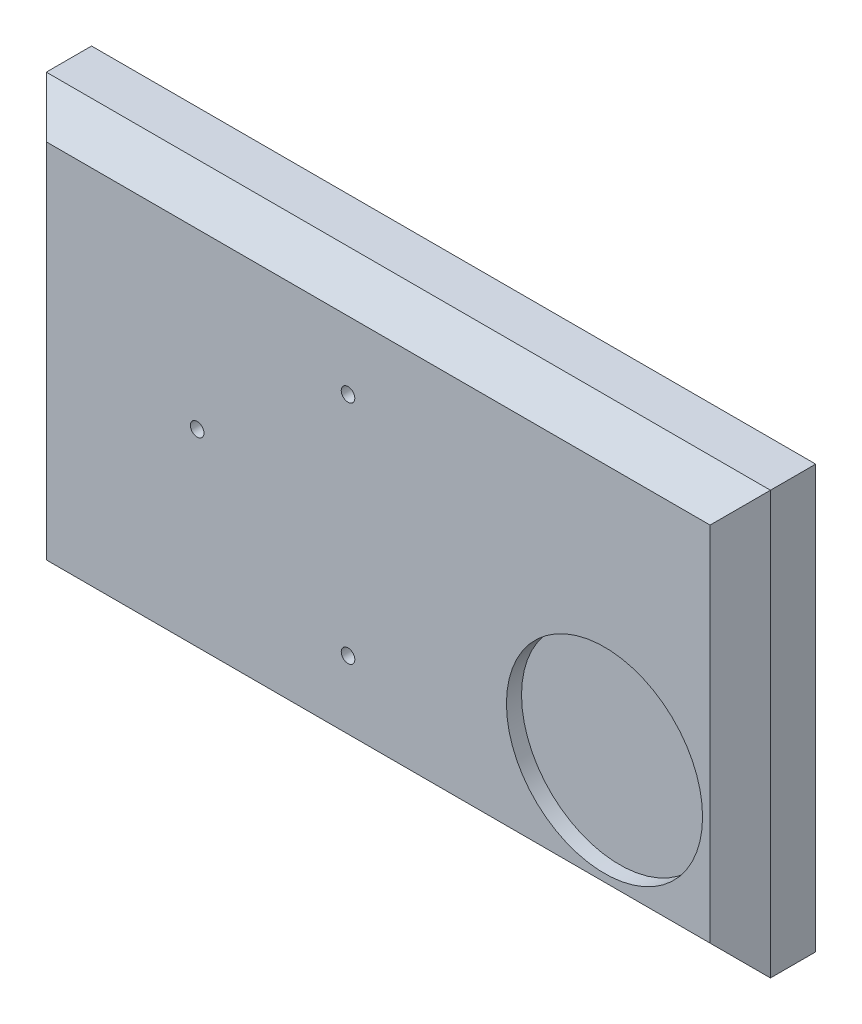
from build123d import *

# Parameters (mm, degrees)
ESQUISSE1_W                                     = 240
ESQUISSE1_H                                     = 140
BOSS_EXTRU_1_DEPTH                              = 25
CHAMBRAGE_POUR_VIS_T_TE_CYLINDRIQUE_D           = 4.5
CHAMBRAGE_POUR_VIS_T_TE_CYLINDRIQUE_CBORE_D     = 8
CHAMBRAGE_POUR_VIS_T_TE_CYLINDRIQUE_CBORE_DEPTH = 4
CHANFREIN1_SIZE                                 = 10
ESQUISSE4_R                                     = 32.5
ENL_V_MAT_EXTRU_1_DEPTH                         = 5


with BuildPart() as part:
    # Esquisse1 → Boss.-Extru.1 (new body)
    with BuildSketch(Plane.XY):
        Rectangle(ESQUISSE1_W, ESQUISSE1_H)
    extrude(amount=BOSS_EXTRU_1_DEPTH)

    # Chambrage pour vis _ t_te cylindrique (through all)
    with Locations(Plane(origin=(0, 0, 0), x_dir=(-1, 0, 0), z_dir=(0, 0, -1))):
        with Locations((10, 37.5), (10, -37.5), (60, 2.5)):
            CounterBoreHole(CHAMBRAGE_POUR_VIS_T_TE_CYLINDRIQUE_D / 2, CHAMBRAGE_POUR_VIS_T_TE_CYLINDRIQUE_CBORE_D / 2, CHAMBRAGE_POUR_VIS_T_TE_CYLINDRIQUE_CBORE_DEPTH)

    # Chanfrein1
    chanfrein1_edges = [part.edges().sort_by_distance(p)[0] for p in [
        (-120, 0, 25),
        (0, -70, 25),
        (120, 0, 25),
        (0, 70, 25),
    ]]
    chamfer(chanfrein1_edges, length=CHANFREIN1_SIZE)

    # Esquisse4 → Enl_v. mat.-Extru.1 (cut)
    with BuildSketch(Plane.XY.offset(25)):
        with Locations((75, -25)):
            Circle(ESQUISSE4_R)
    extrude(amount=-ENL_V_MAT_EXTRU_1_DEPTH, mode=Mode.SUBTRACT)


solid = part.part
